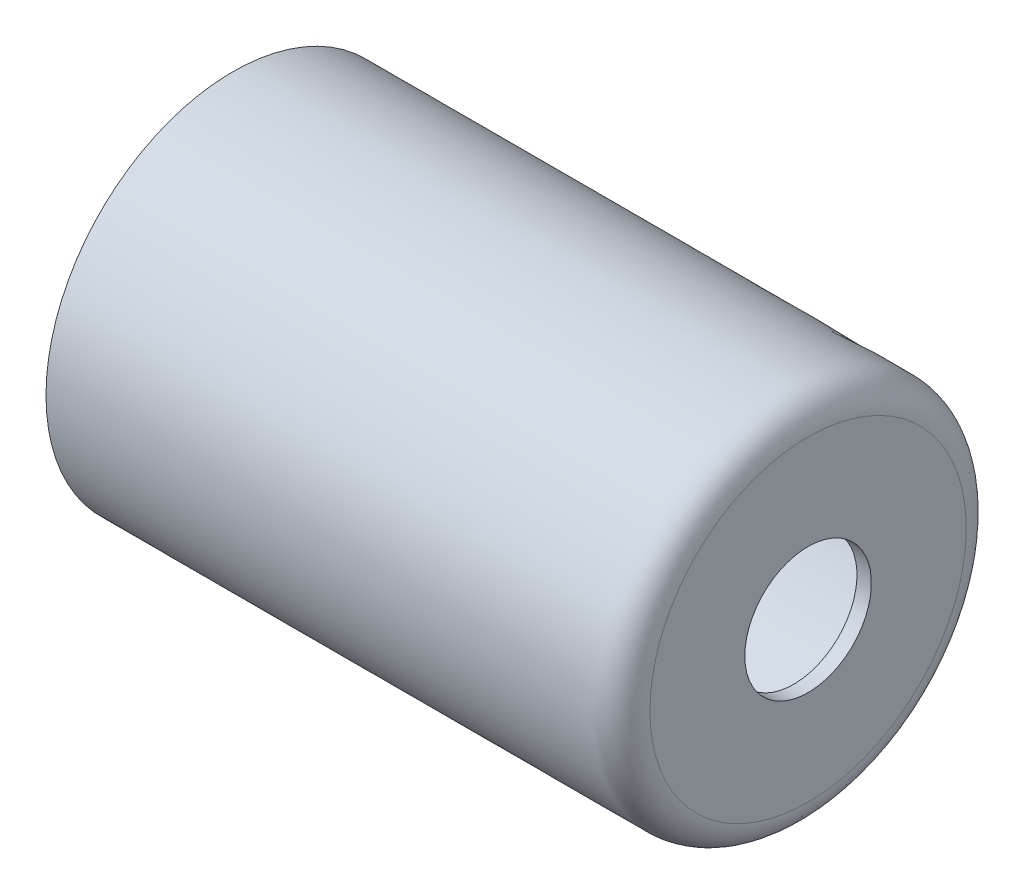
ISO-10303-21;
HEADER;
FILE_DESCRIPTION(('STEP AP214'),'2;1');
FILE_NAME('part.step','',(''),(''),'','','');
FILE_SCHEMA(('AUTOMOTIVE_DESIGN { 1 0 10303 214 1 1 1 1 }'));
ENDSEC;
DATA;
#1=APPLICATION_CONTEXT('core data for automotive mechanical design processes');
#2=APPLICATION_PROTOCOL_DEFINITION('international standard','automotive_design',2000,#1);
#3=PRODUCT_CONTEXT('',#1,'mechanical');
#4=PRODUCT('Part','Part','',(#3));
#5=PRODUCT_RELATED_PRODUCT_CATEGORY('part','',(#4));
#6=PRODUCT_DEFINITION_FORMATION('','',#4);
#7=PRODUCT_DEFINITION_CONTEXT('part definition',#1,'design');
#8=PRODUCT_DEFINITION('design','',#6,#7);
#9=PRODUCT_DEFINITION_SHAPE('','',#8);
#10=(LENGTH_UNIT() NAMED_UNIT(*) SI_UNIT(.MILLI.,.METRE.));
#11=(NAMED_UNIT(*) PLANE_ANGLE_UNIT() SI_UNIT($,.RADIAN.));
#12=(NAMED_UNIT(*) SI_UNIT($,.STERADIAN.) SOLID_ANGLE_UNIT());
#13=UNCERTAINTY_MEASURE_WITH_UNIT(LENGTH_MEASURE(1.E-05),#10,'distance_accuracy_value','');
#14=(GEOMETRIC_REPRESENTATION_CONTEXT(3) GLOBAL_UNCERTAINTY_ASSIGNED_CONTEXT((#13)) GLOBAL_UNIT_ASSIGNED_CONTEXT((#10,
#11,#12)) REPRESENTATION_CONTEXT('',''));
#15=CARTESIAN_POINT('',(0.,0.,0.));
#16=DIRECTION('',(0.,0.,1.));
#17=DIRECTION('',(1.,0.,0.));
#18=AXIS2_PLACEMENT_3D('',#15,#16,#17);
#19=CARTESIAN_POINT('',(9.75,2.75000000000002,0.));
#20=DIRECTION('',(1.,0.,0.));
#21=DIRECTION('',(0.,0.,-1.00000000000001));
#22=AXIS2_PLACEMENT_3D('',#19,#20,#21);
#23=PLANE('',#22);
#24=CARTESIAN_POINT('',(9.75,0.,0.));
#25=DIRECTION('',(-1.,0.,0.));
#26=DIRECTION('',(0.,0.,1.00000000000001));
#27=AXIS2_PLACEMENT_3D('',#24,#25,#26);
#28=CIRCLE('',#27,1.1);
#29=CARTESIAN_POINT('',(9.75,0.,1.10000000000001));
#30=VERTEX_POINT('',#29);
#31=EDGE_CURVE('E10',#30,#30,#28,.T.);
#32=ORIENTED_EDGE('',*,*,#31,.F.);
#33=EDGE_LOOP('',(#32));
#34=FACE_BOUND('',#33,.T.);
#35=CARTESIAN_POINT('',(9.75,0.,0.));
#36=DIRECTION('',(-1.,0.,0.));
#37=DIRECTION('',(0.,0.,1.00000000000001));
#38=AXIS2_PLACEMENT_3D('',#35,#36,#37);
#39=CIRCLE('',#38,2.75);
#40=CARTESIAN_POINT('',(9.75,0.,2.75000000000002));
#41=VERTEX_POINT('',#40);
#42=EDGE_CURVE('E53',#41,#41,#39,.T.);
#43=ORIENTED_EDGE('',*,*,#42,.T.);
#44=EDGE_LOOP('',(#43));
#45=FACE_BOUND('',#44,.T.);
#46=ADVANCED_FACE('F31',(#34,#45),#23,.F.);
#47=CARTESIAN_POINT('',(0.,0.,0.));
#48=DIRECTION('',(-1.,0.,0.));
#49=DIRECTION('',(0.,0.,1.00000000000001));
#50=AXIS2_PLACEMENT_3D('',#47,#48,#49);
#51=CYLINDRICAL_SURFACE('',#50,1.1);
#52=ORIENTED_EDGE('',*,*,#31,.T.);
#53=EDGE_LOOP('',(#52));
#54=FACE_BOUND('',#53,.T.);
#55=CARTESIAN_POINT('',(10.,0.,0.));
#56=DIRECTION('',(-1.,0.,0.));
#57=DIRECTION('',(0.,0.,1.00000000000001));
#58=AXIS2_PLACEMENT_3D('',#55,#56,#57);
#59=CIRCLE('',#58,1.1);
#60=CARTESIAN_POINT('',(10.,0.,1.10000000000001));
#61=VERTEX_POINT('',#60);
#62=EDGE_CURVE('E37',#61,#61,#59,.T.);
#63=ORIENTED_EDGE('',*,*,#62,.F.);
#64=EDGE_LOOP('',(#63));
#65=FACE_BOUND('',#64,.T.);
#66=ADVANCED_FACE('F81',(#54,#65),#51,.F.);
#67=CARTESIAN_POINT('',(10.,2.75000000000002,0.));
#68=DIRECTION('',(1.,0.,0.));
#69=DIRECTION('',(0.,0.,-1.00000000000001));
#70=AXIS2_PLACEMENT_3D('',#67,#68,#69);
#71=PLANE('',#70);
#72=ORIENTED_EDGE('',*,*,#62,.T.);
#73=EDGE_LOOP('',(#72));
#74=FACE_BOUND('',#73,.T.);
#75=CARTESIAN_POINT('',(10.,0.,0.));
#76=DIRECTION('',(-1.,0.,0.));
#77=DIRECTION('',(0.,0.,1.00000000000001));
#78=AXIS2_PLACEMENT_3D('',#75,#76,#77);
#79=CIRCLE('',#78,2.75);
#80=CARTESIAN_POINT('',(10.,0.,2.75000000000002));
#81=VERTEX_POINT('',#80);
#82=EDGE_CURVE('E41',#81,#81,#79,.T.);
#83=ORIENTED_EDGE('',*,*,#82,.F.);
#84=EDGE_LOOP('',(#83));
#85=FACE_BOUND('',#84,.T.);
#86=ADVANCED_FACE('F78',(#74,#85),#71,.T.);
#87=CARTESIAN_POINT('',(0.,3.25000000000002,0.));
#88=CARTESIAN_POINT('',(3.12887068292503,3.25000000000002,0.));
#89=CARTESIAN_POINT('',(6.25774136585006,3.25000000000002,0.));
#90=CARTESIAN_POINT('',(9.38661204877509,3.25000000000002,0.));
#91=CARTESIAN_POINT('',(9.3992107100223,3.25000000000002,0.));
#92=CARTESIAN_POINT('',(9.42440803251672,3.25000000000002,0.));
#93=CARTESIAN_POINT('',(9.46220401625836,3.25000000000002,0.));
#94=CARTESIAN_POINT('',(9.48740133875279,3.25000000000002,0.));
#95=CARTESIAN_POINT('',(9.5,3.25000000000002,0.));
#96=CARTESIAN_POINT('',(9.5126524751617,3.25000000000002,0.));
#97=CARTESIAN_POINT('',(9.5379574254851,3.25000000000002,0.));
#98=CARTESIAN_POINT('',(9.57594120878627,3.24468587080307,0.));
#99=CARTESIAN_POINT('',(9.60080723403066,3.23989589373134,0.));
#100=CARTESIAN_POINT('',(9.6131315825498,3.23703310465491,0.));
#101=CARTESIAN_POINT('',(9.84923608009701,3.18218903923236,0.));
#102=CARTESIAN_POINT('',(10.,2.99239060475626,0.));
#103=CARTESIAN_POINT('',(10.,2.75000000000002,0.));
#104=(BOUNDED_CURVE() B_SPLINE_CURVE(3,(#87,#88,#89,#90,#91,#92,#93,#94,#95,#96,#97,#98,#99,
#100,#101,#102,#103),.UNSPECIFIED.,.F.,.F.) B_SPLINE_CURVE_WITH_KNOTS((4,3,1,1,3,1,1,3,4),(0.,
0.917032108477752,0.92072461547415,0.924417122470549,0.928109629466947,0.93181790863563,
0.935526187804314,0.939234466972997,1.),
.UNSPECIFIED.) CURVE() GEOMETRIC_REPRESENTATION_ITEM() RATIONAL_B_SPLINE_CURVE((1.,1.,1.,1.,1.,
1.,1.,1.,1.,1.,1.,1.,1.,1.,0.855351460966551,0.855351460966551,1.)) REPRESENTATION_ITEM(''));
#105=CARTESIAN_POINT('',(0.,0.,0.));
#106=DIRECTION('',(-1.,0.,0.));
#107=AXIS1_PLACEMENT('',#105,#106);
#108=SURFACE_OF_REVOLUTION('',#104,#107);
#109=ORIENTED_EDGE('',*,*,#82,.T.);
#110=EDGE_LOOP('',(#109));
#111=FACE_BOUND('',#110,.T.);
#112=CARTESIAN_POINT('',(0.,0.,0.));
#113=DIRECTION('',(-1.,0.,0.));
#114=DIRECTION('',(0.,0.,1.00000000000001));
#115=AXIS2_PLACEMENT_3D('',#112,#113,#114);
#116=CIRCLE('',#115,3.25);
#117=CARTESIAN_POINT('',(0.,0.,3.25000000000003));
#118=VERTEX_POINT('',#117);
#119=EDGE_CURVE('E45',#118,#118,#116,.T.);
#120=ORIENTED_EDGE('',*,*,#119,.F.);
#121=EDGE_LOOP('',(#120));
#122=FACE_BOUND('',#121,.T.);
#123=ADVANCED_FACE('F74',(#111,#122),#108,.F.);
#124=CARTESIAN_POINT('',(0.,3.00000000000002,0.));
#125=DIRECTION('',(-1.,0.,0.));
#126=DIRECTION('',(0.,0.,1.00000000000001));
#127=AXIS2_PLACEMENT_3D('',#124,#125,#126);
#128=PLANE('',#127);
#129=ORIENTED_EDGE('',*,*,#119,.T.);
#130=EDGE_LOOP('',(#129));
#131=FACE_BOUND('',#130,.T.);
#132=CARTESIAN_POINT('',(0.,0.,0.));
#133=DIRECTION('',(-1.,0.,0.));
#134=DIRECTION('',(0.,0.,1.00000000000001));
#135=AXIS2_PLACEMENT_3D('',#132,#133,#134);
#136=CIRCLE('',#135,3.);
#137=CARTESIAN_POINT('',(0.,0.,3.00000000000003));
#138=VERTEX_POINT('',#137);
#139=EDGE_CURVE('E50',#138,#138,#136,.T.);
#140=ORIENTED_EDGE('',*,*,#139,.F.);
#141=EDGE_LOOP('',(#140));
#142=FACE_BOUND('',#141,.T.);
#143=ADVANCED_FACE('F70',(#131,#142),#128,.T.);
#144=CARTESIAN_POINT('',(0.,3.00000000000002,0.));
#145=CARTESIAN_POINT('',(1.70597662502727,3.00000000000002,0.));
#146=CARTESIAN_POINT('',(4.26494156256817,3.00000000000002,0.));
#147=CARTESIAN_POINT('',(7.25040065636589,3.00000000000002,0.));
#148=CARTESIAN_POINT('',(8.63650666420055,3.00000000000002,0.));
#149=CARTESIAN_POINT('',(9.22293612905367,3.00000000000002,0.));
#150=CARTESIAN_POINT('',(9.39619938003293,3.00000000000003,0.));
#151=CARTESIAN_POINT('',(9.46283909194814,3.00000000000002,0.));
#152=CARTESIAN_POINT('',(9.48949497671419,3.00000000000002,0.));
#153=CARTESIAN_POINT('',(9.50488179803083,3.00005451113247,0.));
#154=CARTESIAN_POINT('',(9.52108466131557,2.99984917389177,0.));
#155=CARTESIAN_POINT('',(9.51974942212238,2.99990768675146,0.));
#156=CARTESIAN_POINT('',(9.52961001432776,2.99865706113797,0.));
#157=CARTESIAN_POINT('',(9.53970185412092,2.99700567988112,0.));
#158=CARTESIAN_POINT('',(9.56229607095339,2.99253434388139,0.));
#159=CARTESIAN_POINT('',(9.57395408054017,2.98921363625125,0.));
#160=CARTESIAN_POINT('',(9.59996143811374,2.97956498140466,0.));
#161=CARTESIAN_POINT('',(9.61286829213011,2.97353755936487,0.));
#162=CARTESIAN_POINT('',(9.65032897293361,2.95182756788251,0.));
#163=CARTESIAN_POINT('',(9.67356392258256,2.93239893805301,0.));
#164=CARTESIAN_POINT('',(9.73073725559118,2.86329408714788,0.));
#165=CARTESIAN_POINT('',(9.75,2.80331176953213,0.));
#166=CARTESIAN_POINT('',(9.75,2.75000000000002,0.));
#167=B_SPLINE_CURVE_WITH_KNOTS('',3,(#144,#145,#146,#147,#148,#149,#150,#151,#152,#153,#154,
#155,#156,#157,#158,#159,#160,#161,#162,#163,#164,#165,#166),.UNSPECIFIED.,.F.,.F.,(4,1,1,1,1,1,
2,2,2,2,2,2,2,4),(0.,0.499999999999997,0.749999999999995,0.874999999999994,0.906249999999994,
0.921874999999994,0.925781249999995,0.929687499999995,0.933593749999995,0.937499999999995,
0.945312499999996,0.953124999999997,0.968749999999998,1.),.UNSPECIFIED.);
#168=CARTESIAN_POINT('',(0.,0.,0.));
#169=DIRECTION('',(-1.,0.,0.));
#170=AXIS1_PLACEMENT('',#168,#169);
#171=SURFACE_OF_REVOLUTION('',#167,#170);
#172=ORIENTED_EDGE('',*,*,#42,.F.);
#173=EDGE_LOOP('',(#172));
#174=FACE_BOUND('',#173,.T.);
#175=ORIENTED_EDGE('',*,*,#139,.T.);
#176=EDGE_LOOP('',(#175));
#177=FACE_BOUND('',#176,.T.);
#178=ADVANCED_FACE('F67',(#174,#177),#171,.T.);
#179=CLOSED_SHELL('',(#46,#66,#86,#123,#143,#178));
#180=MANIFOLD_SOLID_BREP('B2',#179);
#181=ADVANCED_BREP_SHAPE_REPRESENTATION('',(#18,#180),#14);
#182=SHAPE_DEFINITION_REPRESENTATION(#9,#181);
ENDSEC;
END-ISO-10303-21;
